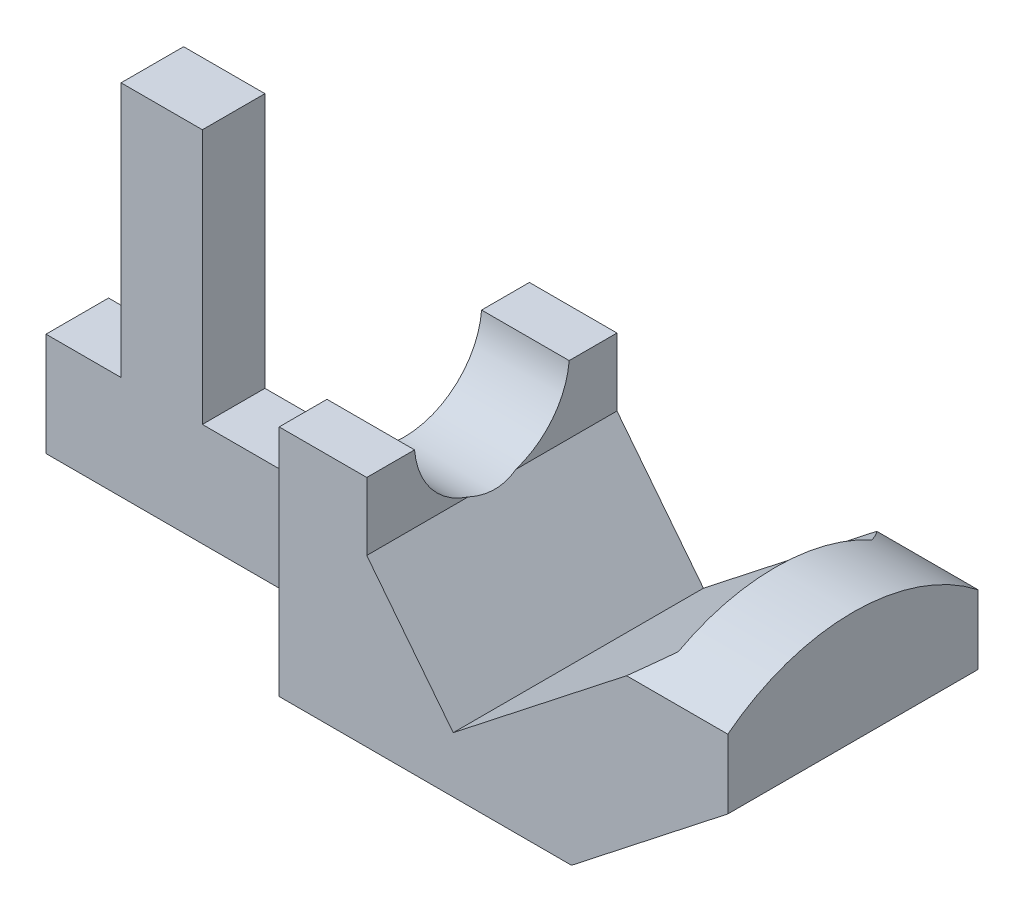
from build123d import *

# Parameters (mm, degrees)
SKETCH1_W                      = 101.6
SKETCH1_H                      = 101.6
STOCK_DEPTH                    = 3.175
SKETCH2_OUTSIDE_W              = 132.344
SKETCH2_OUTSIDE_H              = 132.344
MAIN_SHAPE_DEPTH               = 6.35
EXTRUDE2_DEPTH                 = 9.525
CAMERA_SHAFT_REACH             = 77.836
SKETCH4_R                      = 7.874
CAMERA_SHAFT_DIRECTION_2_REACH = 77.836
CUT_EXTRUDE2_REACH             = 79.806
SKETCH5_W                      = 6.35
SKETCH5_H                      = 17.341712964
SKETCH6_W                      = 8.89
SKETCH6_H                      = 4.133712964
CUT_EXTRUDE3_DEPTH             = 119.338446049
SKETCH7_W                      = 7.889174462
SKETCH7_H                      = 25.4
EXTRUDE3_DEPTH                 = 8.636
CUT_EXTRUDE4_REACH             = 102.894


with BuildPart() as part:
    # Sketch1 → stock (new body)
    with BuildSketch(Plane.XY):
        with Locations((-50.8, 50.8)):
            Rectangle(SKETCH1_W, SKETCH1_H)
    stock = extrude(amount=STOCK_DEPTH)

    # Sketch2 outside → main shape (cut)
    with BuildSketch(Plane.XY.offset(3.175)):
        with Locations((-50.8, 50.8)):
            Rectangle(SKETCH2_OUTSIDE_W, SKETCH2_OUTSIDE_H)
        Polygon((-18.935139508, 46.722088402), (-18.935139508, 37.832088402), (-34.800696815, 25.386088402), (-97.675139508, 25.386088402), (-97.675139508, 35.885162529), (-90.055139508, 35.885162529), (-90.055139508, 61.793162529), (-81.800139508, 61.793162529), (-81.800139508, 35.885162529), (-77.990139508, 35.885162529), (-77.990139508, 42.235162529), (-77.990139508, 53.226875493), (-55.587339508, 53.226875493), (-55.587339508, 42.235162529), (-48.768562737, 33.542916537), (-46.808906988, 31.04484241), (-26.82431397, 46.722088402), align=None, mode=Mode.SUBTRACT)
    main_shape = extrude(amount=-MAIN_SHAPE_DEPTH, mode=Mode.SUBTRACT)

    # Sketch3 → Extrude2 (add)
    with BuildSketch(Plane.XY.offset(3.175)):
        Polygon((-64.477339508, 43.507410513), (-64.477339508, 25.386088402), (-34.800696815, 25.386088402), (-18.935139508, 37.832088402), (-18.935139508, 46.722088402), (-26.82431397, 46.722088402), (-46.808906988, 31.04484241), (-55.587339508, 42.235162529), (-55.587339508, 53.226875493), (-64.477339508, 53.226875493), align=None)
    extrude2 = extrude(amount=EXTRUDE2_DEPTH)

    # Mirror1: stock, main shape, Extrude2 across plane
    add(stock.mirror(Plane.XY))
    add(main_shape.mirror(Plane.XY), mode=Mode.SUBTRACT)
    add(extrude2.mirror(Plane.XY))

    # camera shaft: up to this face of the body (flat: up to its plane)
    camera_shaft_end = Plane(part.part.faces().sort_by_distance((-64.477339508, 39.306481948, 7.9375))[0])
    # Sketch4 → camera shaft (cut, up to the picked face)
    with BuildSketch(Plane(origin=(-55.587339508, 0, 0), x_dir=(0, 0, -1), z_dir=(1, 0, 0)), mode=Mode.PRIVATE) as camera_shaft_sk1:
        with Locations((0, 49.72661554)):
            Circle(SKETCH4_R)
    camera_shaft_tool1 = split(extrude(camera_shaft_sk1.sketch, amount=-CAMERA_SHAFT_REACH, mode=Mode.PRIVATE), bisect_by=camera_shaft_end, keep=Keep.BOTH, mode=Mode.PRIVATE)
    add(camera_shaft_tool1.solids().sort_by(Axis((-55.58734, 49.726616, 0), (-1, 0, 0)))[0], mode=Mode.SUBTRACT)

    # Sketch4 → camera shaft direction 2 (cut, up to next)
    with BuildSketch(Plane(origin=(-55.587339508, 0, 0), x_dir=(0, 0, -1), z_dir=(1, 0, 0)), mode=Mode.PRIVATE) as camera_shaft_direction_2_sk1:
        with Locations((0, 49.72661554)):
            Circle(SKETCH4_R)
    camera_shaft_direction_2_tool1 = extrude(camera_shaft_direction_2_sk1.sketch, amount=CAMERA_SHAFT_DIRECTION_2_REACH, mode=Mode.PRIVATE) & part.part
    add(camera_shaft_direction_2_tool1.solids().sort_by_distance((-55.58734, 49.726616, 0))[0], mode=Mode.SUBTRACT)

    # Sketch5 → Cut-Extrude2 (cut, up to next)
    with BuildSketch(Plane(origin=(-64.477339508, 0, 0), x_dir=(0, 0, -1), z_dir=(1, 0, 0)), mode=Mode.PRIVATE) as cut_extrude2_sk1:
        with Locations((0, 44.556019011)):
            Rectangle(SKETCH5_W, SKETCH5_H)
    cut_extrude2_tool1 = extrude(cut_extrude2_sk1.sketch, amount=-CUT_EXTRUDE2_REACH, mode=Mode.PRIVATE) & part.part
    add(cut_extrude2_tool1.solids().sort_by_distance((-64.47734, 44.556019, 0))[0], mode=Mode.SUBTRACT)

    # Sketch6 → Cut-Extrude3 (cut, through all)
    with BuildSketch(Plane.XY.offset(12.7)):
        with Locations((-60.032339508, 51.160019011)):
            Rectangle(SKETCH6_W, SKETCH6_H)
    extrude(amount=-CUT_EXTRUDE3_DEPTH, mode=Mode.SUBTRACT)

    # Sketch7 → Extrude3 (add)
    with BuildSketch(Plane(origin=(0, 46.722088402, 0), x_dir=(-1, 0, 0), z_dir=(0, 1, 0))):
        with Locations((22.879726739, 0)):
            Rectangle(SKETCH7_W, SKETCH7_H)
    extrude(amount=EXTRUDE3_DEPTH)

    # Sketch8 → Cut-Extrude4 (cut, up to next)
    with BuildSketch(Plane(origin=(-18.935139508, 0, 0), x_dir=(0, 0, -1), z_dir=(1, 0, 0)), mode=Mode.PRIVATE) as cut_extrude4_sk1:
        with BuildLine():
            Line((12.7, 44.84969687), (12.7, 55.358088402))
            Line((12.7, 55.358088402), (-12.7, 55.358088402))
            Line((-12.7, 55.358088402), (-12.7, 44.84969687))
            ThreePointArc((-12.7, 44.84969687), (0, 49.220162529), (12.7, 44.84969687))
        make_face()
    cut_extrude4_tool1 = extrude(cut_extrude4_sk1.sketch, amount=-CUT_EXTRUDE4_REACH, mode=Mode.PRIVATE) & part.part
    add(cut_extrude4_tool1.solids().sort_by_distance((-18.93514, 51.485992, 0))[0], mode=Mode.SUBTRACT)


solid = part.part
